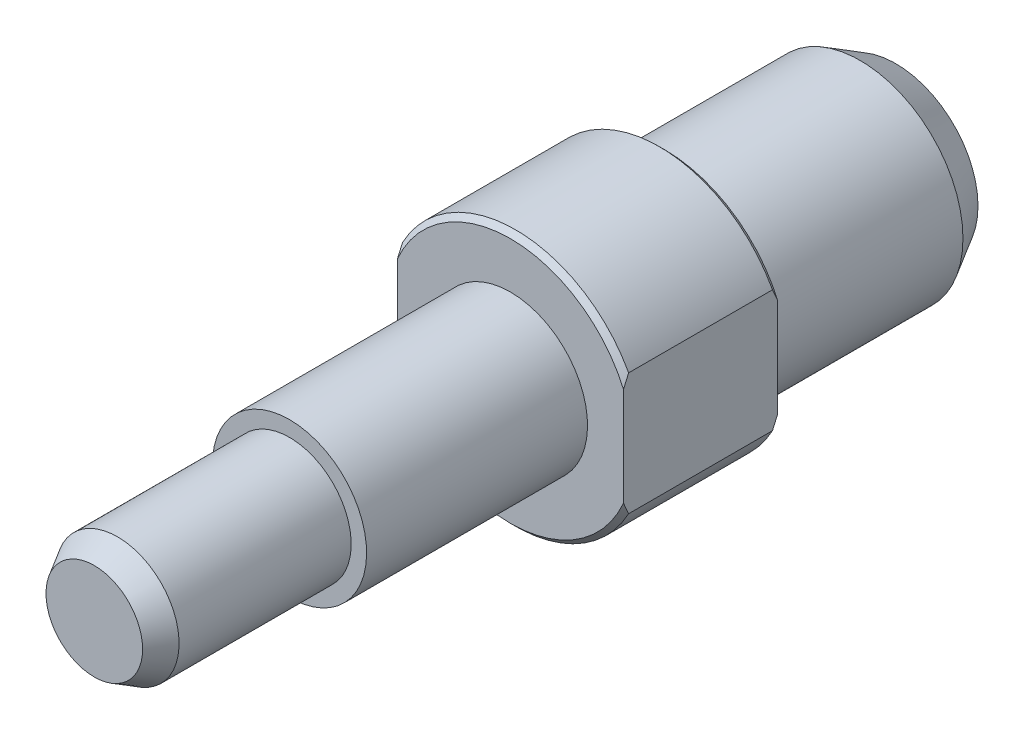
ISO-10303-21;
HEADER;
FILE_DESCRIPTION(('STEP AP214'),'2;1');
FILE_NAME('part.step','',(''),(''),'','','');
FILE_SCHEMA(('AUTOMOTIVE_DESIGN { 1 0 10303 214 1 1 1 1 }'));
ENDSEC;
DATA;
#1=APPLICATION_CONTEXT('core data for automotive mechanical design processes');
#2=APPLICATION_PROTOCOL_DEFINITION('international standard','automotive_design',2000,#1);
#3=PRODUCT_CONTEXT('',#1,'mechanical');
#4=PRODUCT('Part','Part','',(#3));
#5=PRODUCT_RELATED_PRODUCT_CATEGORY('part','',(#4));
#6=PRODUCT_DEFINITION_FORMATION('','',#4);
#7=PRODUCT_DEFINITION_CONTEXT('part definition',#1,'design');
#8=PRODUCT_DEFINITION('design','',#6,#7);
#9=PRODUCT_DEFINITION_SHAPE('','',#8);
#10=(LENGTH_UNIT() NAMED_UNIT(*) SI_UNIT(.MILLI.,.METRE.));
#11=(NAMED_UNIT(*) PLANE_ANGLE_UNIT() SI_UNIT($,.RADIAN.));
#12=(NAMED_UNIT(*) SI_UNIT($,.STERADIAN.) SOLID_ANGLE_UNIT());
#13=UNCERTAINTY_MEASURE_WITH_UNIT(LENGTH_MEASURE(1.E-05),#10,'distance_accuracy_value','');
#14=(GEOMETRIC_REPRESENTATION_CONTEXT(3) GLOBAL_UNCERTAINTY_ASSIGNED_CONTEXT((#13)) GLOBAL_UNIT_ASSIGNED_CONTEXT((#10,
#11,#12)) REPRESENTATION_CONTEXT('',''));
#15=CARTESIAN_POINT('',(0.,0.,0.));
#16=DIRECTION('',(0.,0.,1.));
#17=DIRECTION('',(1.,0.,0.));
#18=AXIS2_PLACEMENT_3D('',#15,#16,#17);
#19=CARTESIAN_POINT('',(0.,0.,55.5));
#20=DIRECTION('',(0.,0.,-1.));
#21=DIRECTION('',(-1.,0.,0.));
#22=AXIS2_PLACEMENT_3D('',#19,#20,#21);
#23=CYLINDRICAL_SURFACE('',#22,6.);
#24=CARTESIAN_POINT('',(0.,0.,36.5));
#25=DIRECTION('',(0.,0.,-1.));
#26=DIRECTION('',(-1.,0.,0.));
#27=AXIS2_PLACEMENT_3D('',#24,#25,#26);
#28=CIRCLE('',#27,6.);
#29=CARTESIAN_POINT('',(-6.,0.,36.5));
#30=VERTEX_POINT('',#29);
#31=EDGE_CURVE('E139',#30,#30,#28,.T.);
#32=ORIENTED_EDGE('',*,*,#31,.F.);
#33=EDGE_LOOP('',(#32));
#34=FACE_BOUND('',#33,.T.);
#35=CARTESIAN_POINT('',(0.,0.,53.2483339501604));
#36=DIRECTION('',(0.,0.,-1.));
#37=DIRECTION('',(-1.,0.,0.));
#38=AXIS2_PLACEMENT_3D('',#35,#36,#37);
#39=CIRCLE('',#38,6.);
#40=CARTESIAN_POINT('',(-6.,0.,53.2483339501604));
#41=VERTEX_POINT('',#40);
#42=EDGE_CURVE('E19',#41,#41,#39,.F.);
#43=ORIENTED_EDGE('',*,*,#42,.F.);
#44=EDGE_LOOP('',(#43));
#45=FACE_BOUND('',#44,.T.);
#46=ADVANCED_FACE('F14',(#34,#45),#23,.T.);
#47=CARTESIAN_POINT('',(0.,0.,0.));
#48=DIRECTION('',(0.,0.,-1.));
#49=DIRECTION('',(-1.,0.,0.));
#50=AXIS2_PLACEMENT_3D('',#47,#48,#49);
#51=CYLINDRICAL_SURFACE('',#50,10.);
#52=CARTESIAN_POINT('',(0.,0.,0.));
#53=DIRECTION('',(0.,0.,-1.));
#54=DIRECTION('',(-1.,0.,0.));
#55=AXIS2_PLACEMENT_3D('',#52,#53,#54);
#56=CIRCLE('',#55,10.);
#57=CARTESIAN_POINT('',(-10.,0.,0.));
#58=VERTEX_POINT('',#57);
#59=EDGE_CURVE('E138',#58,#58,#56,.T.);
#60=ORIENTED_EDGE('',*,*,#59,.T.);
#61=EDGE_LOOP('',(#60));
#62=FACE_BOUND('',#61,.T.);
#63=CARTESIAN_POINT('',(0.,0.,-19.0358983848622));
#64=DIRECTION('',(0.,0.,1.));
#65=DIRECTION('',(1.,0.,0.));
#66=AXIS2_PLACEMENT_3D('',#63,#64,#65);
#67=CIRCLE('',#66,10.);
#68=CARTESIAN_POINT('',(10.,0.,-19.0358983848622));
#69=VERTEX_POINT('',#68);
#70=EDGE_CURVE('E146',#69,#69,#67,.F.);
#71=ORIENTED_EDGE('',*,*,#70,.F.);
#72=EDGE_LOOP('',(#71));
#73=FACE_BOUND('',#72,.T.);
#74=ADVANCED_FACE('F244',(#62,#73),#51,.T.);
#75=CARTESIAN_POINT('',(-11.,-12.65,0.));
#76=DIRECTION('',(0.,0.,1.));
#77=DIRECTION('',(1.,0.,0.));
#78=AXIS2_PLACEMENT_3D('',#75,#76,#77);
#79=PLANE('',#78);
#80=ORIENTED_EDGE('',*,*,#59,.F.);
#81=EDGE_LOOP('',(#80));
#82=FACE_BOUND('',#81,.T.);
#83=DIRECTION('',(0.,-1.,0.));
#84=VECTOR('',#83,1.);
#85=CARTESIAN_POINT('',(11.,0.,0.));
#86=LINE('',#85,#84);
#87=CARTESIAN_POINT('',(11.,4.79583152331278,0.));
#88=VERTEX_POINT('',#87);
#89=CARTESIAN_POINT('',(11.,-4.79583152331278,0.));
#90=VERTEX_POINT('',#89);
#91=EDGE_CURVE('E126',#88,#90,#86,.T.);
#92=ORIENTED_EDGE('',*,*,#91,.T.);
#93=CARTESIAN_POINT('',(0.,0.,0.));
#94=DIRECTION('',(0.,0.,1.));
#95=DIRECTION('',(1.,0.,0.));
#96=AXIS2_PLACEMENT_3D('',#93,#94,#95);
#97=CIRCLE('',#96,12.);
#98=CARTESIAN_POINT('',(-11.,-4.79583152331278,0.));
#99=VERTEX_POINT('',#98);
#100=EDGE_CURVE('E212',#90,#99,#97,.F.);
#101=ORIENTED_EDGE('',*,*,#100,.T.);
#102=DIRECTION('',(0.,-1.,0.));
#103=VECTOR('',#102,1.);
#104=CARTESIAN_POINT('',(-11.,0.,0.));
#105=LINE('',#104,#103);
#106=CARTESIAN_POINT('',(-11.,4.79583152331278,0.));
#107=VERTEX_POINT('',#106);
#108=EDGE_CURVE('E134',#107,#99,#105,.T.);
#109=ORIENTED_EDGE('',*,*,#108,.F.);
#110=CARTESIAN_POINT('',(0.,0.,0.));
#111=DIRECTION('',(0.,0.,1.));
#112=DIRECTION('',(1.,0.,0.));
#113=AXIS2_PLACEMENT_3D('',#110,#111,#112);
#114=CIRCLE('',#113,12.);
#115=EDGE_CURVE('E209',#107,#88,#114,.F.);
#116=ORIENTED_EDGE('',*,*,#115,.T.);
#117=EDGE_LOOP('',(#92,#101,#109,#116));
#118=FACE_BOUND('',#117,.T.);
#119=ADVANCED_FACE('F251',(#82,#118),#79,.F.);
#120=CARTESIAN_POINT('',(0.,0.,15.));
#121=DIRECTION('',(0.,0.,-1.));
#122=DIRECTION('',(-1.,0.,0.));
#123=AXIS2_PLACEMENT_3D('',#120,#121,#122);
#124=CYLINDRICAL_SURFACE('',#123,12.5);
#125=DIRECTION('',(0.,0.,-1.));
#126=VECTOR('',#125,1.);
#127=CARTESIAN_POINT('',(-11.,5.937171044,7.5));
#128=LINE('',#127,#126);
#129=CARTESIAN_POINT('',(-11.,5.937171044,14.5));
#130=VERTEX_POINT('',#129);
#131=CARTESIAN_POINT('',(-11.,5.937171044,0.50000000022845));
#132=VERTEX_POINT('',#131);
#133=EDGE_CURVE('E132',#130,#132,#128,.T.);
#134=ORIENTED_EDGE('',*,*,#133,.F.);
#135=CARTESIAN_POINT('',(0.,0.,14.5));
#136=DIRECTION('',(0.,0.,1.));
#137=DIRECTION('',(1.,0.,0.));
#138=AXIS2_PLACEMENT_3D('',#135,#136,#137);
#139=CIRCLE('',#138,12.5);
#140=CARTESIAN_POINT('',(11.,5.937171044,14.4999999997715));
#141=VERTEX_POINT('',#140);
#142=EDGE_CURVE('E9',#130,#141,#139,.F.);
#143=ORIENTED_EDGE('',*,*,#142,.T.);
#144=DIRECTION('',(0.,0.,-1.));
#145=VECTOR('',#144,1.);
#146=CARTESIAN_POINT('',(11.,5.937171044,7.5));
#147=LINE('',#146,#145);
#148=CARTESIAN_POINT('',(11.,5.937171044,0.499999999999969));
#149=VERTEX_POINT('',#148);
#150=EDGE_CURVE('E118',#141,#149,#147,.T.);
#151=ORIENTED_EDGE('',*,*,#150,.T.);
#152=CARTESIAN_POINT('',(0.,0.,0.499999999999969));
#153=DIRECTION('',(0.,0.,1.));
#154=DIRECTION('',(1.,0.,0.));
#155=AXIS2_PLACEMENT_3D('',#152,#153,#154);
#156=CIRCLE('',#155,12.5);
#157=EDGE_CURVE('E24',#149,#132,#156,.T.);
#158=ORIENTED_EDGE('',*,*,#157,.T.);
#159=EDGE_LOOP('',(#134,#143,#151,#158));
#160=FACE_BOUND('',#159,.T.);
#161=ADVANCED_FACE('F261',(#160),#124,.T.);
#162=CARTESIAN_POINT('',(-11.,-5.937171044,0.));
#163=DIRECTION('',(-1.,0.,0.));
#164=DIRECTION('',(0.,0.,1.));
#165=AXIS2_PLACEMENT_3D('',#162,#163,#164);
#166=PLANE('',#165);
#167=DIRECTION('',(0.,0.,-1.));
#168=VECTOR('',#167,1.);
#169=CARTESIAN_POINT('',(-11.0000000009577,-5.93717104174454,7.5));
#170=LINE('',#169,#168);
#171=CARTESIAN_POINT('',(-11.0000000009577,-5.93717104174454,0.499999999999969));
#172=VERTEX_POINT('',#171);
#173=CARTESIAN_POINT('',(-11.0000000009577,-5.93717104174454,14.5));
#174=VERTEX_POINT('',#173);
#175=EDGE_CURVE('E129',#172,#174,#170,.F.);
#176=ORIENTED_EDGE('',*,*,#175,.T.);
#177=CARTESIAN_POINT('',(-11.0000000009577,-5.93717104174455,14.5));
#178=CARTESIAN_POINT('',(-11.0000000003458,-5.84334950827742,14.5445621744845));
#179=CARTESIAN_POINT('',(-11.0000000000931,-5.7492102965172,14.58845840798));
#180=CARTESIAN_POINT('',(-10.9999999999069,-5.56030813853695,14.6748237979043));
#181=CARTESIAN_POINT('',(-10.9999999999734,-5.46554535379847,14.7172933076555));
#182=CARTESIAN_POINT('',(-11.0000000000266,-5.27535928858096,14.8007330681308));
#183=CARTESIAN_POINT('',(-11.0000000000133,-5.1799359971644,14.841703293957));
#184=CARTESIAN_POINT('',(-10.9999999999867,-4.98839837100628,14.9220630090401));
#185=CARTESIAN_POINT('',(-10.9999999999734,-4.89228386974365,14.9614521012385));
#186=CARTESIAN_POINT('',(-11.,-4.79583152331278,15.));
#187=B_SPLINE_CURVE_WITH_KNOTS('',3,(#177,#178,#179,#180,#181,#182,#183,#184,#185,#186),
.UNSPECIFIED.,.F.,.F.,(4,2,2,2,4),(0.,0.311598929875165,0.623120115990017,0.934646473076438,
1.24625057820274),.UNSPECIFIED.);
#188=CARTESIAN_POINT('',(-11.,-4.79583152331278,15.));
#189=VERTEX_POINT('',#188);
#190=EDGE_CURVE('E197',#174,#189,#187,.T.);
#191=ORIENTED_EDGE('',*,*,#190,.T.);
#192=DIRECTION('',(0.,-1.,0.));
#193=VECTOR('',#192,1.);
#194=CARTESIAN_POINT('',(-11.,0.,15.));
#195=LINE('',#194,#193);
#196=CARTESIAN_POINT('',(-11.,4.79583152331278,15.));
#197=VERTEX_POINT('',#196);
#198=EDGE_CURVE('E105',#197,#189,#195,.T.);
#199=ORIENTED_EDGE('',*,*,#198,.F.);
#200=CARTESIAN_POINT('',(-11.,4.79583152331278,15.));
#201=CARTESIAN_POINT('',(-11.,4.89228386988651,14.9614521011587));
#202=CARTESIAN_POINT('',(-11.,4.98839837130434,14.9220630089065));
#203=CARTESIAN_POINT('',(-11.,5.1799359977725,14.8417032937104));
#204=CARTESIAN_POINT('',(-11.,5.27535928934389,14.8007330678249));
#205=CARTESIAN_POINT('',(-11.,5.46554535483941,14.71729330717));
#206=CARTESIAN_POINT('',(-11.,5.56030813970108,14.6748237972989));
#207=CARTESIAN_POINT('',(-11.,5.74921029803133,14.5884584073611));
#208=CARTESIAN_POINT('',(-11.,5.84334951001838,14.5445621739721));
#209=CARTESIAN_POINT('',(-11.,5.93717104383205,14.4999999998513));
#210=B_SPLINE_CURVE_WITH_KNOTS('',3,(#200,#201,#202,#203,#204,#205,#206,#207,#208,#209),
.UNSPECIFIED.,.F.,.F.,(4,2,2,2,4),(0.,0.311604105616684,0.623130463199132,0.934651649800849,
1.24625058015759),.UNSPECIFIED.);
#211=EDGE_CURVE('E198',#197,#130,#210,.T.);
#212=ORIENTED_EDGE('',*,*,#211,.T.);
#213=ORIENTED_EDGE('',*,*,#133,.T.);
#214=CARTESIAN_POINT('',(-10.9999999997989,5.93717104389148,0.499999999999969));
#215=CARTESIAN_POINT('',(-10.9999999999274,5.84334951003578,0.455437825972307));
#216=CARTESIAN_POINT('',(-10.9999999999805,5.74921029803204,0.411541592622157));
#217=CARTESIAN_POINT('',(-11.0000000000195,5.56030813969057,0.325176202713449));
#218=CARTESIAN_POINT('',(-11.0000000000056,5.46554535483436,0.282706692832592));
#219=CARTESIAN_POINT('',(-10.9999999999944,5.27535928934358,0.199266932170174));
#220=CARTESIAN_POINT('',(-10.9999999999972,5.17993599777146,0.158296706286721));
#221=CARTESIAN_POINT('',(-11.0000000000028,4.98839837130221,0.0779369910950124));
#222=CARTESIAN_POINT('',(-11.0000000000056,4.89228386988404,0.038547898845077));
#223=CARTESIAN_POINT('',(-11.,4.79583152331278,0.));
#224=B_SPLINE_CURVE_WITH_KNOTS('',3,(#214,#215,#216,#217,#218,#219,#220,#221,#222,#223),
.UNSPECIFIED.,.F.,.F.,(4,2,2,2,4),(0.,0.311598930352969,0.623120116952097,0.934646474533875,
1.24625058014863),.UNSPECIFIED.);
#225=EDGE_CURVE('E40',#132,#107,#224,.T.);
#226=ORIENTED_EDGE('',*,*,#225,.T.);
#227=ORIENTED_EDGE('',*,*,#108,.T.);
#228=CARTESIAN_POINT('',(-11.,-4.79583152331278,0.));
#229=CARTESIAN_POINT('',(-11.,-4.89228386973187,0.0385478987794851));
#230=CARTESIAN_POINT('',(-11.,-4.98839837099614,0.0779369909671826));
#231=CARTESIAN_POINT('',(-11.,-5.17993599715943,0.158296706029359));
#232=CARTESIAN_POINT('',(-11.,-5.27535928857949,0.199266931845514));
#233=CARTESIAN_POINT('',(-11.,-5.46554535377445,0.282706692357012));
#234=CARTESIAN_POINT('',(-11.,-5.56030813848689,0.325176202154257));
#235=CARTESIAN_POINT('',(-11.,-5.74921029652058,0.411541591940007));
#236=CARTESIAN_POINT('',(-11.,-5.84334950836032,0.455437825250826));
#237=CARTESIAN_POINT('',(-11.,-5.93717104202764,0.499999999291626));
#238=B_SPLINE_CURVE_WITH_KNOTS('',3,(#228,#229,#230,#231,#232,#233,#234,#235,#236,#237),
.UNSPECIFIED.,.F.,.F.,(4,2,2,2,4),(0.,0.311604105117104,0.623130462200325,0.934651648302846,
1.24625057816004),.UNSPECIFIED.);
#239=EDGE_CURVE('E32',#99,#172,#238,.T.);
#240=ORIENTED_EDGE('',*,*,#239,.T.);
#241=EDGE_LOOP('',(#176,#191,#199,#212,#213,#226,#227,#240));
#242=FACE_BOUND('',#241,.T.);
#243=ADVANCED_FACE('F164',(#242),#166,.T.);
#244=CARTESIAN_POINT('',(0.,0.,15.));
#245=DIRECTION('',(0.,0.,-1.));
#246=DIRECTION('',(-1.,0.,0.));
#247=AXIS2_PLACEMENT_3D('',#244,#245,#246);
#248=CYLINDRICAL_SURFACE('',#247,12.5);
#249=DIRECTION('',(0.,0.,1.));
#250=VECTOR('',#249,1.);
#251=CARTESIAN_POINT('',(11.,-5.937171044,7.5));
#252=LINE('',#251,#250);
#253=CARTESIAN_POINT('',(11.,-5.937171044,0.50000000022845));
#254=VERTEX_POINT('',#253);
#255=CARTESIAN_POINT('',(11.,-5.937171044,14.5));
#256=VERTEX_POINT('',#255);
#257=EDGE_CURVE('E124',#254,#256,#252,.T.);
#258=ORIENTED_EDGE('',*,*,#257,.T.);
#259=CARTESIAN_POINT('',(0.,0.,14.5));
#260=DIRECTION('',(0.,0.,1.));
#261=DIRECTION('',(1.,0.,0.));
#262=AXIS2_PLACEMENT_3D('',#259,#260,#261);
#263=CIRCLE('',#262,12.5);
#264=EDGE_CURVE('E89',#256,#174,#263,.F.);
#265=ORIENTED_EDGE('',*,*,#264,.T.);
#266=ORIENTED_EDGE('',*,*,#175,.F.);
#267=CARTESIAN_POINT('',(0.,0.,0.499999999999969));
#268=DIRECTION('',(0.,0.,1.));
#269=DIRECTION('',(1.,0.,0.));
#270=AXIS2_PLACEMENT_3D('',#267,#268,#269);
#271=CIRCLE('',#270,12.5);
#272=EDGE_CURVE('E94',#172,#254,#271,.T.);
#273=ORIENTED_EDGE('',*,*,#272,.T.);
#274=EDGE_LOOP('',(#258,#265,#266,#273));
#275=FACE_BOUND('',#274,.T.);
#276=ADVANCED_FACE('F163',(#275),#248,.T.);
#277=CARTESIAN_POINT('',(11.,5.937171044,0.));
#278=DIRECTION('',(-1.,0.,0.));
#279=DIRECTION('',(0.,-1.,0.));
#280=AXIS2_PLACEMENT_3D('',#277,#278,#279);
#281=PLANE('',#280);
#282=DIRECTION('',(0.,1.,0.));
#283=VECTOR('',#282,1.);
#284=CARTESIAN_POINT('',(11.,0.,15.));
#285=LINE('',#284,#283);
#286=CARTESIAN_POINT('',(11.,-4.79583152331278,15.));
#287=VERTEX_POINT('',#286);
#288=CARTESIAN_POINT('',(11.,4.79583152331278,15.));
#289=VERTEX_POINT('',#288);
#290=EDGE_CURVE('E102',#287,#289,#285,.T.);
#291=ORIENTED_EDGE('',*,*,#290,.F.);
#292=CARTESIAN_POINT('',(11.,-4.79583152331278,15.));
#293=CARTESIAN_POINT('',(11.,-4.89228386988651,14.9614521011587));
#294=CARTESIAN_POINT('',(11.,-4.98839837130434,14.9220630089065));
#295=CARTESIAN_POINT('',(11.,-5.1799359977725,14.8417032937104));
#296=CARTESIAN_POINT('',(11.,-5.27535928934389,14.8007330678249));
#297=CARTESIAN_POINT('',(11.,-5.46554535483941,14.71729330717));
#298=CARTESIAN_POINT('',(11.,-5.56030813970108,14.6748237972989));
#299=CARTESIAN_POINT('',(11.,-5.74921029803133,14.5884584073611));
#300=CARTESIAN_POINT('',(11.,-5.84334951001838,14.5445621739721));
#301=CARTESIAN_POINT('',(11.,-5.93717104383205,14.4999999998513));
#302=B_SPLINE_CURVE_WITH_KNOTS('',3,(#292,#293,#294,#295,#296,#297,#298,#299,#300,#301),
.UNSPECIFIED.,.F.,.F.,(4,2,2,2,4),(0.,0.311604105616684,0.623130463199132,0.934651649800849,
1.24625058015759),.UNSPECIFIED.);
#303=EDGE_CURVE('E84',#287,#256,#302,.T.);
#304=ORIENTED_EDGE('',*,*,#303,.T.);
#305=ORIENTED_EDGE('',*,*,#257,.F.);
#306=CARTESIAN_POINT('',(10.9999999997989,-5.93717104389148,0.499999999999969));
#307=CARTESIAN_POINT('',(10.9999999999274,-5.84334951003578,0.455437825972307));
#308=CARTESIAN_POINT('',(10.9999999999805,-5.74921029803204,0.411541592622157));
#309=CARTESIAN_POINT('',(11.0000000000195,-5.56030813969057,0.325176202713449));
#310=CARTESIAN_POINT('',(11.0000000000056,-5.46554535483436,0.282706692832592));
#311=CARTESIAN_POINT('',(10.9999999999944,-5.27535928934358,0.199266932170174));
#312=CARTESIAN_POINT('',(10.9999999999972,-5.17993599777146,0.158296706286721));
#313=CARTESIAN_POINT('',(11.0000000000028,-4.98839837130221,0.0779369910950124));
#314=CARTESIAN_POINT('',(11.0000000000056,-4.89228386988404,0.038547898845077));
#315=CARTESIAN_POINT('',(11.,-4.79583152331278,0.));
#316=B_SPLINE_CURVE_WITH_KNOTS('',3,(#306,#307,#308,#309,#310,#311,#312,#313,#314,#315),
.UNSPECIFIED.,.F.,.F.,(4,2,2,2,4),(0.,0.311598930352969,0.623120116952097,0.934646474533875,
1.24625058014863),.UNSPECIFIED.);
#317=EDGE_CURVE('E95',#254,#90,#316,.T.);
#318=ORIENTED_EDGE('',*,*,#317,.T.);
#319=ORIENTED_EDGE('',*,*,#91,.F.);
#320=CARTESIAN_POINT('',(11.,4.79583152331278,0.));
#321=CARTESIAN_POINT('',(11.,4.89228386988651,0.03854789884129));
#322=CARTESIAN_POINT('',(11.,4.98839837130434,0.0779369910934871));
#323=CARTESIAN_POINT('',(11.,5.1799359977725,0.158296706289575));
#324=CARTESIAN_POINT('',(11.,5.27535928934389,0.199266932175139));
#325=CARTESIAN_POINT('',(11.,5.4655453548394,0.282706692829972));
#326=CARTESIAN_POINT('',(11.,5.56030813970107,0.325176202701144));
#327=CARTESIAN_POINT('',(11.,5.74921029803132,0.411541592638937));
#328=CARTESIAN_POINT('',(11.,5.84334951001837,0.455437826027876));
#329=CARTESIAN_POINT('',(11.,5.93717104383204,0.500000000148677));
#330=B_SPLINE_CURVE_WITH_KNOTS('',3,(#320,#321,#322,#323,#324,#325,#326,#327,#328,#329),
.UNSPECIFIED.,.F.,.F.,(4,2,2,2,4),(0.,0.31160410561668,0.623130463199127,0.93465164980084,
1.24625058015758),.UNSPECIFIED.);
#331=EDGE_CURVE('E106',#88,#149,#330,.T.);
#332=ORIENTED_EDGE('',*,*,#331,.T.);
#333=ORIENTED_EDGE('',*,*,#150,.F.);
#334=CARTESIAN_POINT('',(10.9999999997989,5.93717104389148,14.5));
#335=CARTESIAN_POINT('',(10.9999999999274,5.84334951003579,14.5445621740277));
#336=CARTESIAN_POINT('',(10.9999999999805,5.74921029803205,14.5884584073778));
#337=CARTESIAN_POINT('',(11.0000000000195,5.56030813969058,14.6748237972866));
#338=CARTESIAN_POINT('',(11.0000000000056,5.46554535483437,14.7172933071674));
#339=CARTESIAN_POINT('',(10.9999999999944,5.27535928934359,14.8007330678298));
#340=CARTESIAN_POINT('',(10.9999999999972,5.17993599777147,14.8417032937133));
#341=CARTESIAN_POINT('',(11.0000000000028,4.98839837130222,14.922063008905));
#342=CARTESIAN_POINT('',(11.0000000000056,4.89228386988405,14.9614521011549));
#343=CARTESIAN_POINT('',(11.,4.79583152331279,15.));
#344=B_SPLINE_CURVE_WITH_KNOTS('',3,(#334,#335,#336,#337,#338,#339,#340,#341,#342,#343),
.UNSPECIFIED.,.F.,.F.,(4,2,2,2,4),(0.,0.31159893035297,0.623120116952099,0.934646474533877,
1.24625058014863),.UNSPECIFIED.);
#345=EDGE_CURVE('E112',#141,#289,#344,.T.);
#346=ORIENTED_EDGE('',*,*,#345,.T.);
#347=EDGE_LOOP('',(#291,#304,#305,#318,#319,#332,#333,#346));
#348=FACE_BOUND('',#347,.T.);
#349=ADVANCED_FACE('F109',(#348),#281,.F.);
#350=CARTESIAN_POINT('',(-11.,-12.65,15.));
#351=DIRECTION('',(0.,0.,1.));
#352=DIRECTION('',(1.,0.,0.));
#353=AXIS2_PLACEMENT_3D('',#350,#351,#352);
#354=PLANE('',#353);
#355=CARTESIAN_POINT('',(0.,0.,15.));
#356=DIRECTION('',(0.,0.,-1.));
#357=DIRECTION('',(0.,1.,0.));
#358=AXIS2_PLACEMENT_3D('',#355,#356,#357);
#359=CIRCLE('',#358,7.5);
#360=CARTESIAN_POINT('',(0.,7.49999999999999,15.));
#361=VERTEX_POINT('',#360);
#362=EDGE_CURVE('E113',#361,#361,#359,.T.);
#363=ORIENTED_EDGE('',*,*,#362,.T.);
#364=EDGE_LOOP('',(#363));
#365=FACE_BOUND('',#364,.T.);
#366=ORIENTED_EDGE('',*,*,#198,.T.);
#367=CARTESIAN_POINT('',(0.,0.,15.));
#368=DIRECTION('',(0.,0.,1.));
#369=DIRECTION('',(1.,0.,0.));
#370=AXIS2_PLACEMENT_3D('',#367,#368,#369);
#371=CIRCLE('',#370,12.);
#372=EDGE_CURVE('E88',#189,#287,#371,.T.);
#373=ORIENTED_EDGE('',*,*,#372,.T.);
#374=ORIENTED_EDGE('',*,*,#290,.T.);
#375=CARTESIAN_POINT('',(0.,0.,15.));
#376=DIRECTION('',(0.,0.,1.));
#377=DIRECTION('',(1.,0.,0.));
#378=AXIS2_PLACEMENT_3D('',#375,#376,#377);
#379=CIRCLE('',#378,12.);
#380=EDGE_CURVE('E107',#289,#197,#379,.T.);
#381=ORIENTED_EDGE('',*,*,#380,.T.);
#382=EDGE_LOOP('',(#366,#373,#374,#381));
#383=FACE_BOUND('',#382,.T.);
#384=ADVANCED_FACE('F100',(#365,#383),#354,.T.);
#385=CARTESIAN_POINT('',(0.,0.,36.5));
#386=DIRECTION('',(0.,0.,-1.));
#387=DIRECTION('',(0.,1.,0.));
#388=AXIS2_PLACEMENT_3D('',#385,#386,#387);
#389=CYLINDRICAL_SURFACE('',#388,7.5);
#390=ORIENTED_EDGE('',*,*,#362,.F.);
#391=EDGE_LOOP('',(#390));
#392=FACE_BOUND('',#391,.T.);
#393=CARTESIAN_POINT('',(0.,0.,36.5));
#394=DIRECTION('',(0.,0.,-1.));
#395=DIRECTION('',(0.,1.,0.));
#396=AXIS2_PLACEMENT_3D('',#393,#394,#395);
#397=CIRCLE('',#396,7.5);
#398=CARTESIAN_POINT('',(0.,7.5,36.5));
#399=VERTEX_POINT('',#398);
#400=EDGE_CURVE('E116',#399,#399,#397,.F.);
#401=ORIENTED_EDGE('',*,*,#400,.F.);
#402=EDGE_LOOP('',(#401));
#403=FACE_BOUND('',#402,.T.);
#404=ADVANCED_FACE('F258',(#392,#403),#389,.T.);
#405=CARTESIAN_POINT('',(-7.59,-7.59,36.5));
#406=DIRECTION('',(0.,0.,1.));
#407=DIRECTION('',(1.,0.,0.));
#408=AXIS2_PLACEMENT_3D('',#405,#406,#407);
#409=PLANE('',#408);
#410=ORIENTED_EDGE('',*,*,#31,.T.);
#411=EDGE_LOOP('',(#410));
#412=FACE_BOUND('',#411,.T.);
#413=ORIENTED_EDGE('',*,*,#400,.T.);
#414=EDGE_LOOP('',(#413));
#415=FACE_BOUND('',#414,.T.);
#416=ADVANCED_FACE('F254',(#412,#415),#409,.T.);
#417=CARTESIAN_POINT('',(0.,0.,15.));
#418=DIRECTION('',(0.,0.,-1.));
#419=DIRECTION('',(-1.,0.,0.));
#420=AXIS2_PLACEMENT_3D('',#417,#418,#419);
#421=CONICAL_SURFACE('',#420,12.,0.785398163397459);
#422=ORIENTED_EDGE('',*,*,#190,.F.);
#423=ORIENTED_EDGE('',*,*,#264,.F.);
#424=ORIENTED_EDGE('',*,*,#303,.F.);
#425=ORIENTED_EDGE('',*,*,#372,.F.);
#426=EDGE_LOOP('',(#422,#423,#424,#425));
#427=FACE_BOUND('',#426,.T.);
#428=ADVANCED_FACE('F87',(#427),#421,.T.);
#429=CARTESIAN_POINT('',(0.,0.,0.));
#430=DIRECTION('',(0.,0.,1.));
#431=DIRECTION('',(1.,0.,0.));
#432=AXIS2_PLACEMENT_3D('',#429,#430,#431);
#433=CONICAL_SURFACE('',#432,12.,0.785398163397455);
#434=ORIENTED_EDGE('',*,*,#317,.F.);
#435=ORIENTED_EDGE('',*,*,#272,.F.);
#436=ORIENTED_EDGE('',*,*,#239,.F.);
#437=ORIENTED_EDGE('',*,*,#100,.F.);
#438=EDGE_LOOP('',(#434,#435,#436,#437));
#439=FACE_BOUND('',#438,.T.);
#440=ADVANCED_FACE('F182',(#439),#433,.T.);
#441=CARTESIAN_POINT('',(0.,0.,15.));
#442=DIRECTION('',(0.,0.,-1.));
#443=DIRECTION('',(-1.,0.,0.));
#444=AXIS2_PLACEMENT_3D('',#441,#442,#443);
#445=CONICAL_SURFACE('',#444,12.,0.785398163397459);
#446=ORIENTED_EDGE('',*,*,#345,.F.);
#447=ORIENTED_EDGE('',*,*,#142,.F.);
#448=ORIENTED_EDGE('',*,*,#211,.F.);
#449=ORIENTED_EDGE('',*,*,#380,.F.);
#450=EDGE_LOOP('',(#446,#447,#448,#449));
#451=FACE_BOUND('',#450,.T.);
#452=ADVANCED_FACE('F185',(#451),#445,.T.);
#453=CARTESIAN_POINT('',(0.,0.,0.));
#454=DIRECTION('',(0.,0.,1.));
#455=DIRECTION('',(1.,0.,0.));
#456=AXIS2_PLACEMENT_3D('',#453,#454,#455);
#457=CONICAL_SURFACE('',#456,12.,0.785398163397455);
#458=ORIENTED_EDGE('',*,*,#225,.F.);
#459=ORIENTED_EDGE('',*,*,#157,.F.);
#460=ORIENTED_EDGE('',*,*,#331,.F.);
#461=ORIENTED_EDGE('',*,*,#115,.F.);
#462=EDGE_LOOP('',(#458,#459,#460,#461));
#463=FACE_BOUND('',#462,.T.);
#464=ADVANCED_FACE('F16',(#463),#457,.T.);
#465=CARTESIAN_POINT('',(0.,0.,-13.2071113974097));
#466=DIRECTION('',(0.,0.,1.));
#467=DIRECTION('',(1.,0.,0.));
#468=AXIS2_PLACEMENT_3D('',#465,#466,#467);
#469=CONICAL_SURFACE('',#468,13.3652517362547,0.523598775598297);
#470=CARTESIAN_POINT('',(0.,0.,-22.5));
#471=DIRECTION('',(0.,0.,1.));
#472=DIRECTION('',(1.,0.,0.));
#473=AXIS2_PLACEMENT_3D('',#470,#471,#472);
#474=CIRCLE('',#473,8.);
#475=CARTESIAN_POINT('',(8.,0.,-22.5));
#476=VERTEX_POINT('',#475);
#477=EDGE_CURVE('E121',#476,#476,#474,.T.);
#478=ORIENTED_EDGE('',*,*,#477,.T.);
#479=EDGE_LOOP('',(#478));
#480=FACE_BOUND('',#479,.T.);
#481=ORIENTED_EDGE('',*,*,#70,.T.);
#482=EDGE_LOOP('',(#481));
#483=FACE_BOUND('',#482,.T.);
#484=ADVANCED_FACE('F239',(#480,#483),#469,.T.);
#485=CARTESIAN_POINT('',(-10.12,-10.12,-22.5));
#486=DIRECTION('',(0.,0.,1.));
#487=DIRECTION('',(1.,0.,0.));
#488=AXIS2_PLACEMENT_3D('',#485,#486,#487);
#489=PLANE('',#488);
#490=ORIENTED_EDGE('',*,*,#477,.F.);
#491=EDGE_LOOP('',(#490));
#492=FACE_BOUND('',#491,.T.);
#493=ADVANCED_FACE('F231',(#492),#489,.F.);
#494=CARTESIAN_POINT('',(0.,0.,55.5));
#495=DIRECTION('',(0.,0.,-1.));
#496=DIRECTION('',(-1.,0.,0.));
#497=AXIS2_PLACEMENT_3D('',#494,#495,#496);
#498=CONICAL_SURFACE('',#497,4.7,0.523598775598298);
#499=CARTESIAN_POINT('',(0.,0.,55.5));
#500=DIRECTION('',(0.,0.,1.));
#501=DIRECTION('',(1.,0.,0.));
#502=AXIS2_PLACEMENT_3D('',#499,#500,#501);
#503=CIRCLE('',#502,4.7);
#504=CARTESIAN_POINT('',(4.7,0.,55.5));
#505=VERTEX_POINT('',#504);
#506=EDGE_CURVE('E221',#505,#505,#503,.T.);
#507=ORIENTED_EDGE('',*,*,#506,.F.);
#508=EDGE_LOOP('',(#507));
#509=FACE_BOUND('',#508,.T.);
#510=ORIENTED_EDGE('',*,*,#42,.T.);
#511=EDGE_LOOP('',(#510));
#512=FACE_BOUND('',#511,.T.);
#513=ADVANCED_FACE('F229',(#509,#512),#498,.T.);
#514=CARTESIAN_POINT('',(-6.072,-6.072,55.5));
#515=DIRECTION('',(0.,0.,1.));
#516=DIRECTION('',(1.,0.,0.));
#517=AXIS2_PLACEMENT_3D('',#514,#515,#516);
#518=PLANE('',#517);
#519=ORIENTED_EDGE('',*,*,#506,.T.);
#520=EDGE_LOOP('',(#519));
#521=FACE_BOUND('',#520,.T.);
#522=ADVANCED_FACE('F227',(#521),#518,.T.);
#523=CLOSED_SHELL('',(#46,#74,#119,#161,#243,#276,#349,#384,#404,#416,#428,#440,#452,#464,#484,
#493,#513,#522));
#524=MANIFOLD_SOLID_BREP('B1',#523);
#525=ADVANCED_BREP_SHAPE_REPRESENTATION('',(#18,#524),#14);
#526=SHAPE_DEFINITION_REPRESENTATION(#9,#525);
ENDSEC;
END-ISO-10303-21;
